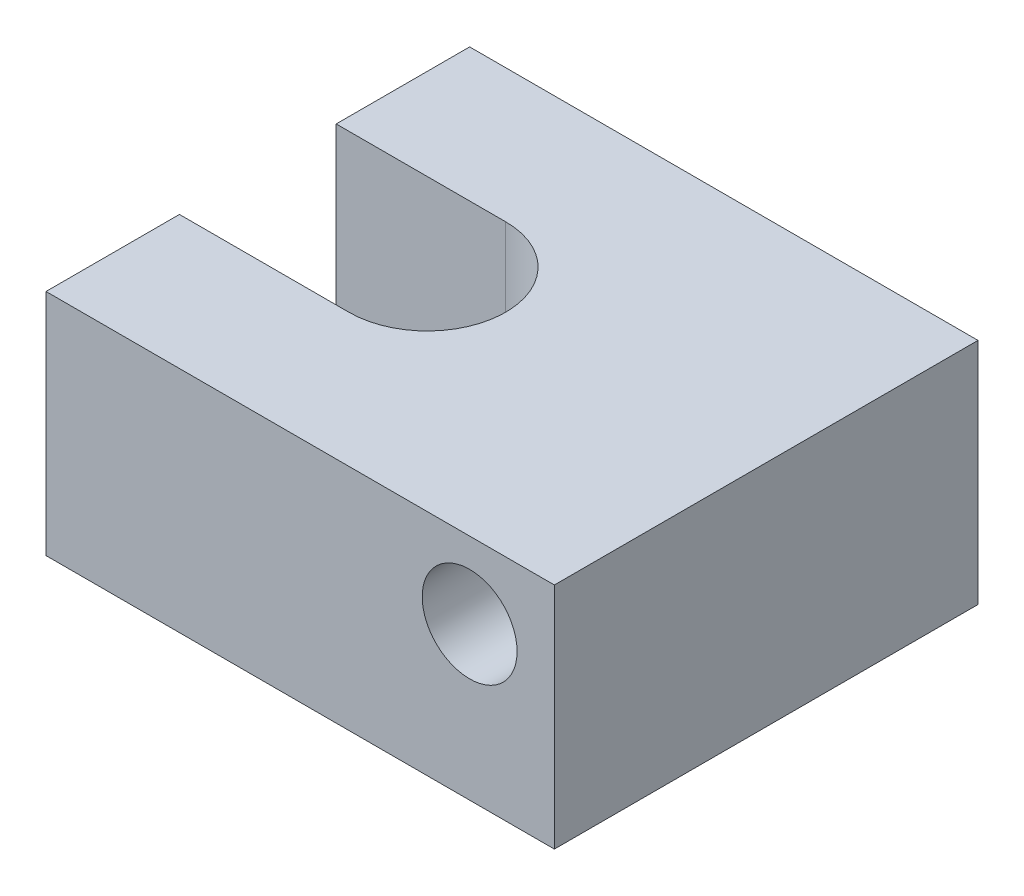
ISO-10303-21;
HEADER;
FILE_DESCRIPTION(('STEP AP214'),'2;1');
FILE_NAME('part.step','',(''),(''),'','','');
FILE_SCHEMA(('AUTOMOTIVE_DESIGN { 1 0 10303 214 1 1 1 1 }'));
ENDSEC;
DATA;
#1=APPLICATION_CONTEXT('core data for automotive mechanical design processes');
#2=APPLICATION_PROTOCOL_DEFINITION('international standard','automotive_design',2000,#1);
#3=PRODUCT_CONTEXT('',#1,'mechanical');
#4=PRODUCT('Part','Part','',(#3));
#5=PRODUCT_RELATED_PRODUCT_CATEGORY('part','',(#4));
#6=PRODUCT_DEFINITION_FORMATION('','',#4);
#7=PRODUCT_DEFINITION_CONTEXT('part definition',#1,'design');
#8=PRODUCT_DEFINITION('design','',#6,#7);
#9=PRODUCT_DEFINITION_SHAPE('','',#8);
#10=(LENGTH_UNIT() NAMED_UNIT(*) SI_UNIT(.MILLI.,.METRE.));
#11=(NAMED_UNIT(*) PLANE_ANGLE_UNIT() SI_UNIT($,.RADIAN.));
#12=(NAMED_UNIT(*) SI_UNIT($,.STERADIAN.) SOLID_ANGLE_UNIT());
#13=UNCERTAINTY_MEASURE_WITH_UNIT(LENGTH_MEASURE(1.E-05),#10,'distance_accuracy_value','');
#14=(GEOMETRIC_REPRESENTATION_CONTEXT(3) GLOBAL_UNCERTAINTY_ASSIGNED_CONTEXT((#13)) GLOBAL_UNIT_ASSIGNED_CONTEXT((#10,
#11,#12)) REPRESENTATION_CONTEXT('',''));
#15=CARTESIAN_POINT('',(0.,0.,0.));
#16=DIRECTION('',(0.,0.,1.));
#17=DIRECTION('',(1.,0.,0.));
#18=AXIS2_PLACEMENT_3D('',#15,#16,#17);
#19=CARTESIAN_POINT('',(-7.61999999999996,3.42900000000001,-12.7));
#20=DIRECTION('',(-1.,0.,0.));
#21=DIRECTION('',(0.,-1.,0.));
#22=AXIS2_PLACEMENT_3D('',#19,#20,#21);
#23=PLANE('',#22);
#24=DIRECTION('',(0.,1.,0.));
#25=VECTOR('',#24,1.);
#26=CARTESIAN_POINT('',(-7.61999999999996,-3.42899999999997,-4.0005));
#27=LINE('',#26,#25);
#28=CARTESIAN_POINT('',(-7.61999999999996,-3.42899999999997,-4.0005));
#29=VERTEX_POINT('',#28);
#30=CARTESIAN_POINT('',(-7.61999999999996,3.42900000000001,-4.0005));
#31=VERTEX_POINT('',#30);
#32=EDGE_CURVE('E126',#29,#31,#27,.T.);
#33=ORIENTED_EDGE('',*,*,#32,.F.);
#34=DIRECTION('',(0.,0.,1.));
#35=VECTOR('',#34,1.);
#36=CARTESIAN_POINT('',(-7.61999999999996,-3.429,-12.7));
#37=LINE('',#36,#35);
#38=CARTESIAN_POINT('',(-7.61999999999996,-3.429,0.));
#39=VERTEX_POINT('',#38);
#40=EDGE_CURVE('E161',#29,#39,#37,.T.);
#41=ORIENTED_EDGE('',*,*,#40,.T.);
#42=DIRECTION('',(0.,-1.,0.));
#43=VECTOR('',#42,1.);
#44=CARTESIAN_POINT('',(-7.61999999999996,3.42900000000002,0.));
#45=LINE('',#44,#43);
#46=CARTESIAN_POINT('',(-7.61999999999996,3.42900000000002,0.));
#47=VERTEX_POINT('',#46);
#48=EDGE_CURVE('E140',#47,#39,#45,.T.);
#49=ORIENTED_EDGE('',*,*,#48,.F.);
#50=DIRECTION('',(0.,0.,1.));
#51=VECTOR('',#50,1.);
#52=CARTESIAN_POINT('',(-7.61999999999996,3.42900000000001,-12.7));
#53=LINE('',#52,#51);
#54=EDGE_CURVE('E39',#31,#47,#53,.T.);
#55=ORIENTED_EDGE('',*,*,#54,.F.);
#56=EDGE_LOOP('',(#33,#41,#49,#55));
#57=FACE_BOUND('',#56,.T.);
#58=ADVANCED_FACE('F30',(#57),#23,.T.);
#59=DIRECTION('',(0.,1.,0.));
#60=VECTOR('',#59,1.);
#61=CARTESIAN_POINT('',(-7.61999999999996,-3.42899999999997,-8.6995));
#62=LINE('',#61,#60);
#63=CARTESIAN_POINT('',(-7.61999999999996,-3.42899999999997,-8.6995));
#64=VERTEX_POINT('',#63);
#65=CARTESIAN_POINT('',(-7.61999999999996,3.42900000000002,-8.6995));
#66=VERTEX_POINT('',#65);
#67=EDGE_CURVE('E47',#64,#66,#62,.T.);
#68=ORIENTED_EDGE('',*,*,#67,.T.);
#69=CARTESIAN_POINT('',(-7.61999999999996,3.42900000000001,-12.7));
#70=VERTEX_POINT('',#69);
#71=EDGE_CURVE('E11',#70,#66,#53,.T.);
#72=ORIENTED_EDGE('',*,*,#71,.F.);
#73=DIRECTION('',(0.,-1.,0.));
#74=VECTOR('',#73,1.);
#75=CARTESIAN_POINT('',(-7.61999999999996,3.42900000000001,-12.7));
#76=LINE('',#75,#74);
#77=CARTESIAN_POINT('',(-7.61999999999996,-3.429,-12.7));
#78=VERTEX_POINT('',#77);
#79=EDGE_CURVE('E152',#70,#78,#76,.T.);
#80=ORIENTED_EDGE('',*,*,#79,.T.);
#81=EDGE_CURVE('E34',#78,#64,#37,.T.);
#82=ORIENTED_EDGE('',*,*,#81,.T.);
#83=EDGE_LOOP('',(#68,#72,#80,#82));
#84=FACE_BOUND('',#83,.T.);
#85=ADVANCED_FACE('F32',(#84),#23,.T.);
#86=CARTESIAN_POINT('',(-7.61999999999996,3.42900000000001,-12.7));
#87=DIRECTION('',(0.,1.,0.));
#88=DIRECTION('',(0.,0.,1.));
#89=AXIS2_PLACEMENT_3D('',#86,#87,#88);
#90=PLANE('',#89);
#91=DIRECTION('',(1.,0.,0.));
#92=VECTOR('',#91,1.);
#93=CARTESIAN_POINT('',(-2.53999999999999,3.42900000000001,-4.00049999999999));
#94=LINE('',#93,#92);
#95=CARTESIAN_POINT('',(-2.53999999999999,3.42900000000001,-4.00049999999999));
#96=VERTEX_POINT('',#95);
#97=EDGE_CURVE('E115',#31,#96,#94,.T.);
#98=ORIENTED_EDGE('',*,*,#97,.F.);
#99=ORIENTED_EDGE('',*,*,#54,.T.);
#100=DIRECTION('',(-1.,0.,0.));
#101=VECTOR('',#100,1.);
#102=CARTESIAN_POINT('',(-7.61999999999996,3.42900000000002,0.));
#103=LINE('',#102,#101);
#104=CARTESIAN_POINT('',(7.61999999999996,3.42900000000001,0.));
#105=VERTEX_POINT('',#104);
#106=EDGE_CURVE('E149',#105,#47,#103,.T.);
#107=ORIENTED_EDGE('',*,*,#106,.F.);
#108=DIRECTION('',(0.,0.,1.));
#109=VECTOR('',#108,1.);
#110=CARTESIAN_POINT('',(7.62000000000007,3.429,-12.7));
#111=LINE('',#110,#109);
#112=CARTESIAN_POINT('',(7.62000000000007,3.429,-12.7));
#113=VERTEX_POINT('',#112);
#114=EDGE_CURVE('E163',#113,#105,#111,.T.);
#115=ORIENTED_EDGE('',*,*,#114,.F.);
#116=DIRECTION('',(-1.,0.,0.));
#117=VECTOR('',#116,1.);
#118=CARTESIAN_POINT('',(-7.61999999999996,3.42900000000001,-12.7));
#119=LINE('',#118,#117);
#120=EDGE_CURVE('E160',#113,#70,#119,.T.);
#121=ORIENTED_EDGE('',*,*,#120,.T.);
#122=ORIENTED_EDGE('',*,*,#71,.T.);
#123=DIRECTION('',(-1.,0.,0.));
#124=VECTOR('',#123,1.);
#125=CARTESIAN_POINT('',(-2.53999999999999,3.42900000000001,-8.6995));
#126=LINE('',#125,#124);
#127=CARTESIAN_POINT('',(-2.53999999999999,3.42900000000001,-8.6995));
#128=VERTEX_POINT('',#127);
#129=EDGE_CURVE('E98',#128,#66,#126,.T.);
#130=ORIENTED_EDGE('',*,*,#129,.F.);
#131=CARTESIAN_POINT('',(-2.53999999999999,3.429,-6.35));
#132=DIRECTION('',(0.,1.,0.));
#133=DIRECTION('',(0.,0.,1.));
#134=AXIS2_PLACEMENT_3D('',#131,#132,#133);
#135=CIRCLE('',#134,2.3495);
#136=EDGE_CURVE('E106',#96,#128,#135,.T.);
#137=ORIENTED_EDGE('',*,*,#136,.F.);
#138=EDGE_LOOP('',(#98,#99,#107,#115,#121,#122,#130,#137));
#139=FACE_BOUND('',#138,.T.);
#140=ADVANCED_FACE('F113',(#139),#90,.T.);
#141=CARTESIAN_POINT('',(7.62000000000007,3.429,-12.7));
#142=DIRECTION('',(1.,0.,0.));
#143=DIRECTION('',(0.,0.,-1.));
#144=AXIS2_PLACEMENT_3D('',#141,#142,#143);
#145=PLANE('',#144);
#146=DIRECTION('',(0.,1.,0.));
#147=VECTOR('',#146,1.);
#148=CARTESIAN_POINT('',(7.61999999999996,3.42900000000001,0.));
#149=LINE('',#148,#147);
#150=CARTESIAN_POINT('',(7.61999999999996,-3.429,0.));
#151=VERTEX_POINT('',#150);
#152=EDGE_CURVE('E146',#151,#105,#149,.T.);
#153=ORIENTED_EDGE('',*,*,#152,.F.);
#154=DIRECTION('',(0.,0.,1.));
#155=VECTOR('',#154,1.);
#156=CARTESIAN_POINT('',(7.62000000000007,-3.429,-12.7));
#157=LINE('',#156,#155);
#158=CARTESIAN_POINT('',(7.62000000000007,-3.429,-12.7));
#159=VERTEX_POINT('',#158);
#160=EDGE_CURVE('E164',#159,#151,#157,.T.);
#161=ORIENTED_EDGE('',*,*,#160,.F.);
#162=DIRECTION('',(0.,1.,0.));
#163=VECTOR('',#162,1.);
#164=CARTESIAN_POINT('',(7.62000000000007,3.429,-12.7));
#165=LINE('',#164,#163);
#166=EDGE_CURVE('E157',#159,#113,#165,.T.);
#167=ORIENTED_EDGE('',*,*,#166,.T.);
#168=ORIENTED_EDGE('',*,*,#114,.T.);
#169=EDGE_LOOP('',(#153,#161,#167,#168));
#170=FACE_BOUND('',#169,.T.);
#171=ADVANCED_FACE('F190',(#170),#145,.T.);
#172=CARTESIAN_POINT('',(-7.61999999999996,-3.429,-12.7));
#173=DIRECTION('',(0.,-1.,0.));
#174=DIRECTION('',(0.,0.,-1.));
#175=AXIS2_PLACEMENT_3D('',#172,#173,#174);
#176=PLANE('',#175);
#177=DIRECTION('',(1.,0.,0.));
#178=VECTOR('',#177,1.);
#179=CARTESIAN_POINT('',(-2.53999999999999,-3.42899999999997,-4.00049999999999));
#180=LINE('',#179,#178);
#181=CARTESIAN_POINT('',(-2.53999999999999,-3.42899999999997,-4.00049999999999));
#182=VERTEX_POINT('',#181);
#183=EDGE_CURVE('E103',#29,#182,#180,.T.);
#184=ORIENTED_EDGE('',*,*,#183,.T.);
#185=CARTESIAN_POINT('',(-2.53999999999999,-3.429,-6.35));
#186=DIRECTION('',(0.,1.,0.));
#187=DIRECTION('',(0.,0.,1.));
#188=AXIS2_PLACEMENT_3D('',#185,#186,#187);
#189=CIRCLE('',#188,2.3495);
#190=CARTESIAN_POINT('',(-2.53999999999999,-3.42899999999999,-8.6995));
#191=VERTEX_POINT('',#190);
#192=EDGE_CURVE('E117',#182,#191,#189,.T.);
#193=ORIENTED_EDGE('',*,*,#192,.T.);
#194=DIRECTION('',(-1.,0.,0.));
#195=VECTOR('',#194,1.);
#196=CARTESIAN_POINT('',(-2.53999999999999,-3.42899999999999,-8.6995));
#197=LINE('',#196,#195);
#198=EDGE_CURVE('E99',#191,#64,#197,.T.);
#199=ORIENTED_EDGE('',*,*,#198,.T.);
#200=ORIENTED_EDGE('',*,*,#81,.F.);
#201=DIRECTION('',(1.,0.,0.));
#202=VECTOR('',#201,1.);
#203=CARTESIAN_POINT('',(-7.61999999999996,-3.429,-12.7));
#204=LINE('',#203,#202);
#205=EDGE_CURVE('E154',#78,#159,#204,.T.);
#206=ORIENTED_EDGE('',*,*,#205,.T.);
#207=ORIENTED_EDGE('',*,*,#160,.T.);
#208=DIRECTION('',(1.,0.,0.));
#209=VECTOR('',#208,1.);
#210=CARTESIAN_POINT('',(-7.61999999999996,-3.429,0.));
#211=LINE('',#210,#209);
#212=EDGE_CURVE('E143',#39,#151,#211,.T.);
#213=ORIENTED_EDGE('',*,*,#212,.F.);
#214=ORIENTED_EDGE('',*,*,#40,.F.);
#215=EDGE_LOOP('',(#184,#193,#199,#200,#206,#207,#213,#214));
#216=FACE_BOUND('',#215,.T.);
#217=ADVANCED_FACE('F174',(#216),#176,.T.);
#218=CARTESIAN_POINT('',(-7.61999999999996,-3.429,-12.7));
#219=DIRECTION('',(0.,0.,1.));
#220=DIRECTION('',(1.,0.,0.));
#221=AXIS2_PLACEMENT_3D('',#218,#219,#220);
#222=PLANE('',#221);
#223=CARTESIAN_POINT('',(5.08000000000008,1.143,-12.7));
#224=DIRECTION('',(0.,0.,1.));
#225=DIRECTION('',(1.,0.,0.));
#226=AXIS2_PLACEMENT_3D('',#223,#224,#225);
#227=CIRCLE('',#226,1.1303);
#228=CARTESIAN_POINT('',(6.21030000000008,1.143,-12.7));
#229=VERTEX_POINT('',#228);
#230=EDGE_CURVE('E125',#229,#229,#227,.T.);
#231=ORIENTED_EDGE('',*,*,#230,.T.);
#232=EDGE_LOOP('',(#231));
#233=FACE_BOUND('',#232,.T.);
#234=ORIENTED_EDGE('',*,*,#79,.F.);
#235=ORIENTED_EDGE('',*,*,#120,.F.);
#236=ORIENTED_EDGE('',*,*,#166,.F.);
#237=ORIENTED_EDGE('',*,*,#205,.F.);
#238=EDGE_LOOP('',(#234,#235,#236,#237));
#239=FACE_BOUND('',#238,.T.);
#240=ADVANCED_FACE('F183',(#233,#239),#222,.F.);
#241=CARTESIAN_POINT('',(-7.61999999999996,-3.429,0.));
#242=DIRECTION('',(0.,0.,1.));
#243=DIRECTION('',(1.,0.,0.));
#244=AXIS2_PLACEMENT_3D('',#241,#242,#243);
#245=PLANE('',#244);
#246=CARTESIAN_POINT('',(5.07999999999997,1.143,0.));
#247=DIRECTION('',(0.,0.,1.));
#248=DIRECTION('',(1.,0.,0.));
#249=AXIS2_PLACEMENT_3D('',#246,#247,#248);
#250=CIRCLE('',#249,1.42239999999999);
#251=CARTESIAN_POINT('',(6.50239999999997,1.143,0.));
#252=VERTEX_POINT('',#251);
#253=EDGE_CURVE('E137',#252,#252,#250,.T.);
#254=ORIENTED_EDGE('',*,*,#253,.F.);
#255=EDGE_LOOP('',(#254));
#256=FACE_BOUND('',#255,.T.);
#257=ORIENTED_EDGE('',*,*,#48,.T.);
#258=ORIENTED_EDGE('',*,*,#212,.T.);
#259=ORIENTED_EDGE('',*,*,#152,.T.);
#260=ORIENTED_EDGE('',*,*,#106,.T.);
#261=EDGE_LOOP('',(#257,#258,#259,#260));
#262=FACE_BOUND('',#261,.T.);
#263=ADVANCED_FACE('F176',(#256,#262),#245,.T.);
#264=CARTESIAN_POINT('',(5.07999999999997,1.143,0.));
#265=DIRECTION('',(0.,0.,1.));
#266=DIRECTION('',(1.,0.,0.));
#267=AXIS2_PLACEMENT_3D('',#264,#265,#266);
#268=CYLINDRICAL_SURFACE('',#267,1.4224);
#269=CARTESIAN_POINT('',(5.07999999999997,1.143,-5.6900064));
#270=DIRECTION('',(0.,0.,1.));
#271=DIRECTION('',(1.,0.,0.));
#272=AXIS2_PLACEMENT_3D('',#269,#270,#271);
#273=CIRCLE('',#272,1.4224);
#274=CARTESIAN_POINT('',(6.50239999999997,1.143,-5.6900064));
#275=VERTEX_POINT('',#274);
#276=EDGE_CURVE('E134',#275,#275,#273,.T.);
#277=ORIENTED_EDGE('',*,*,#276,.F.);
#278=EDGE_LOOP('',(#277));
#279=FACE_BOUND('',#278,.T.);
#280=ORIENTED_EDGE('',*,*,#253,.T.);
#281=EDGE_LOOP('',(#280));
#282=FACE_BOUND('',#281,.T.);
#283=ADVANCED_FACE('F240',(#279,#282),#268,.F.);
#284=CARTESIAN_POINT('',(6.2103,1.143,-5.6900064));
#285=DIRECTION('',(0.,0.,-1.));
#286=DIRECTION('',(-1.,0.,0.));
#287=AXIS2_PLACEMENT_3D('',#284,#285,#286);
#288=PLANE('',#287);
#289=CARTESIAN_POINT('',(5.07999999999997,1.143,-5.6900064));
#290=DIRECTION('',(0.,0.,1.));
#291=DIRECTION('',(1.,0.,0.));
#292=AXIS2_PLACEMENT_3D('',#289,#290,#291);
#293=CIRCLE('',#292,1.1303);
#294=CARTESIAN_POINT('',(6.21029999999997,1.143,-5.6900064));
#295=VERTEX_POINT('',#294);
#296=EDGE_CURVE('E131',#295,#295,#293,.T.);
#297=ORIENTED_EDGE('',*,*,#296,.F.);
#298=EDGE_LOOP('',(#297));
#299=FACE_BOUND('',#298,.T.);
#300=ORIENTED_EDGE('',*,*,#276,.T.);
#301=EDGE_LOOP('',(#300));
#302=FACE_BOUND('',#301,.T.);
#303=ADVANCED_FACE('F250',(#299,#302),#288,.F.);
#304=CARTESIAN_POINT('',(5.07999999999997,1.143,0.));
#305=DIRECTION('',(0.,0.,1.));
#306=DIRECTION('',(1.,0.,0.));
#307=AXIS2_PLACEMENT_3D('',#304,#305,#306);
#308=CYLINDRICAL_SURFACE('',#307,1.1303);
#309=ORIENTED_EDGE('',*,*,#230,.F.);
#310=EDGE_LOOP('',(#309));
#311=FACE_BOUND('',#310,.T.);
#312=ORIENTED_EDGE('',*,*,#296,.T.);
#313=EDGE_LOOP('',(#312));
#314=FACE_BOUND('',#313,.T.);
#315=ADVANCED_FACE('F260',(#311,#314),#308,.F.);
#316=CARTESIAN_POINT('',(-2.53999999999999,-3.429,-6.35));
#317=DIRECTION('',(0.,1.,0.));
#318=DIRECTION('',(0.,0.,1.));
#319=AXIS2_PLACEMENT_3D('',#316,#317,#318);
#320=CYLINDRICAL_SURFACE('',#319,2.3495);
#321=ORIENTED_EDGE('',*,*,#136,.T.);
#322=DIRECTION('',(0.,1.,0.));
#323=VECTOR('',#322,1.);
#324=CARTESIAN_POINT('',(-2.53999999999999,-3.42899999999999,-8.6995));
#325=LINE('',#324,#323);
#326=EDGE_CURVE('E94',#191,#128,#325,.T.);
#327=ORIENTED_EDGE('',*,*,#326,.F.);
#328=ORIENTED_EDGE('',*,*,#192,.F.);
#329=DIRECTION('',(0.,1.,0.));
#330=VECTOR('',#329,1.);
#331=CARTESIAN_POINT('',(-2.53999999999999,-3.42899999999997,-4.00049999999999));
#332=LINE('',#331,#330);
#333=EDGE_CURVE('E108',#182,#96,#332,.T.);
#334=ORIENTED_EDGE('',*,*,#333,.T.);
#335=EDGE_LOOP('',(#321,#327,#328,#334));
#336=FACE_BOUND('',#335,.T.);
#337=ADVANCED_FACE('F107',(#336),#320,.F.);
#338=CARTESIAN_POINT('',(-2.53999999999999,-3.42899999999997,-4.00049999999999));
#339=DIRECTION('',(0.,0.,1.));
#340=DIRECTION('',(1.,0.,0.));
#341=AXIS2_PLACEMENT_3D('',#338,#339,#340);
#342=PLANE('',#341);
#343=ORIENTED_EDGE('',*,*,#97,.T.);
#344=ORIENTED_EDGE('',*,*,#333,.F.);
#345=ORIENTED_EDGE('',*,*,#183,.F.);
#346=ORIENTED_EDGE('',*,*,#32,.T.);
#347=EDGE_LOOP('',(#343,#344,#345,#346));
#348=FACE_BOUND('',#347,.T.);
#349=ADVANCED_FACE('F179',(#348),#342,.F.);
#350=CARTESIAN_POINT('',(-2.53999999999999,-3.42899999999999,-8.6995));
#351=DIRECTION('',(0.,0.,-1.));
#352=DIRECTION('',(-1.,0.,0.));
#353=AXIS2_PLACEMENT_3D('',#350,#351,#352);
#354=PLANE('',#353);
#355=ORIENTED_EDGE('',*,*,#129,.T.);
#356=ORIENTED_EDGE('',*,*,#67,.F.);
#357=ORIENTED_EDGE('',*,*,#198,.F.);
#358=ORIENTED_EDGE('',*,*,#326,.T.);
#359=EDGE_LOOP('',(#355,#356,#357,#358));
#360=FACE_BOUND('',#359,.T.);
#361=ADVANCED_FACE('F96',(#360),#354,.F.);
#362=CLOSED_SHELL('',(#58,#85,#140,#171,#217,#240,#263,#283,#303,#315,#337,#349,#361));
#363=MANIFOLD_SOLID_BREP('B2',#362);
#364=ADVANCED_BREP_SHAPE_REPRESENTATION('',(#18,#363),#14);
#365=SHAPE_DEFINITION_REPRESENTATION(#9,#364);
ENDSEC;
END-ISO-10303-21;
